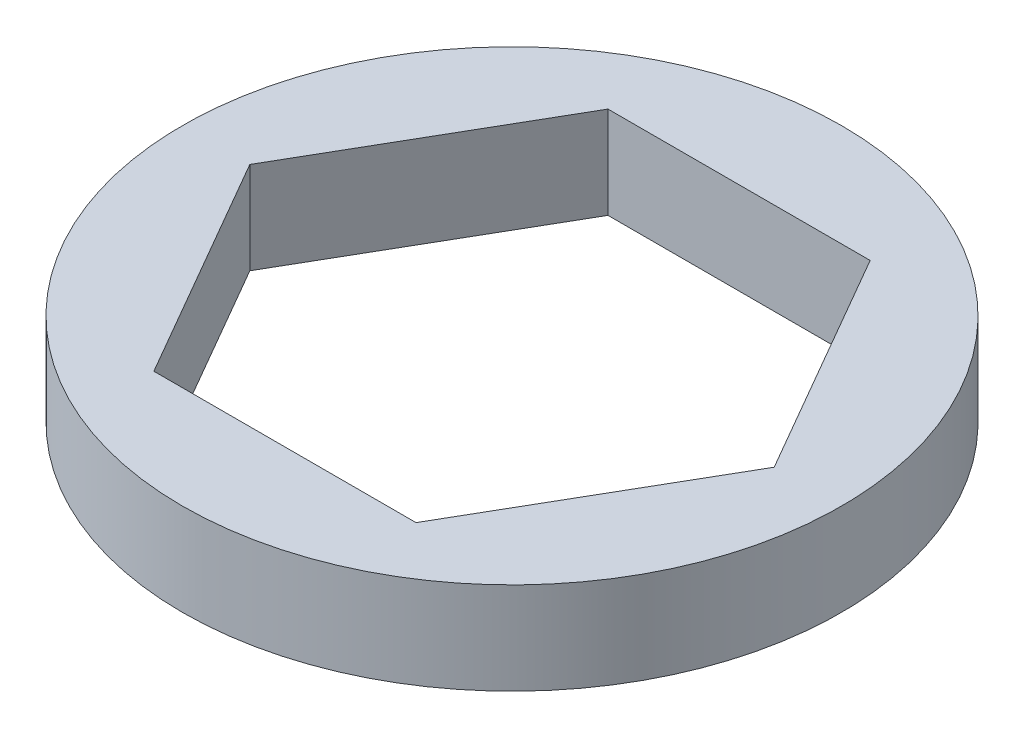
from build123d import *

# Parameters (mm, degrees)
SKETCH1_R           = 5.08
BOSS_EXTRUDE1_DEPTH = 1.419479


with BuildPart() as part:
    # Sketch1 → Boss-Extrude1 (new body)
    with BuildSketch(Plane(origin=(0, 0, 0), x_dir=(1, 0, 0), z_dir=(0, 1, 0))):
        with Locations(Location((0, 0, 0), (0, 0, 270))):
            Circle(SKETCH1_R)
        Polygon((2.020725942, 3.5), (-2.020725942, 3.5), (-4.041451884, 0), (-2.020725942, -3.5), (2.020725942, -3.5), (4.041451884, 0), align=None, mode=Mode.SUBTRACT)
    extrude(amount=BOSS_EXTRUDE1_DEPTH)


solid = part.part
